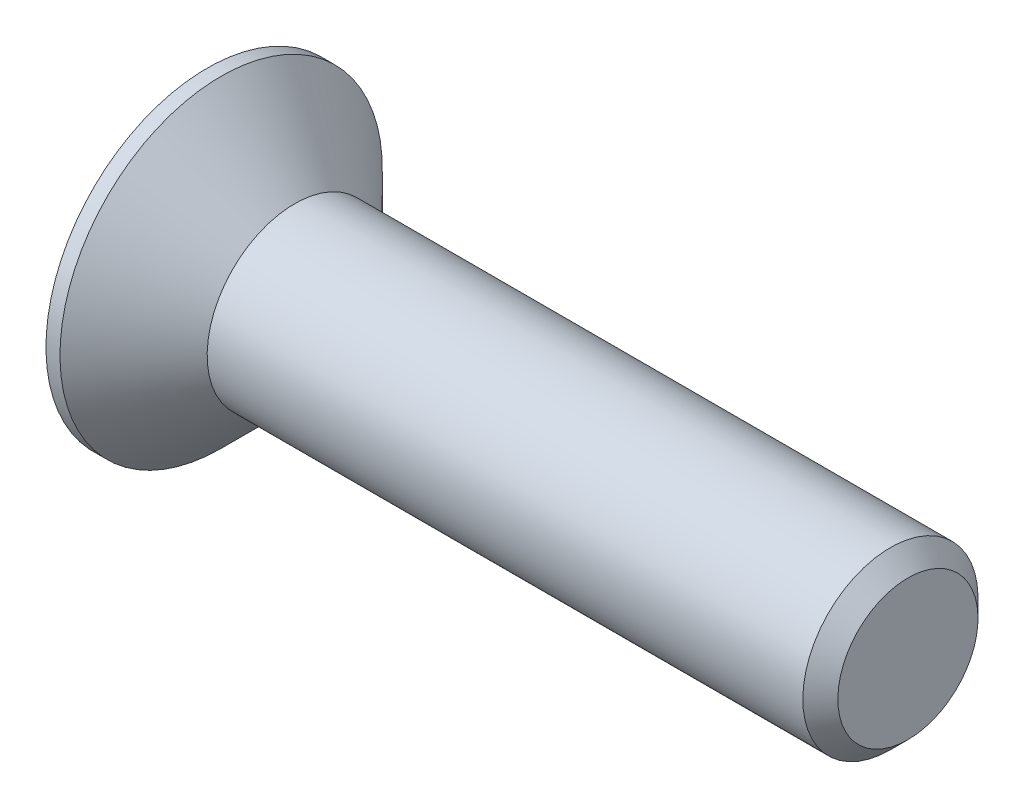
from build123d import *

# Parameters (mm, degrees)
CHAMFER1_SIZE      = 0.5
CUT_EXTRUDE1_DEPTH = 2.1


with BuildPart() as part:
    # Sketch1 → Revolve1 (revolve)
    with BuildSketch(Plane.XY, mode=Mode.PRIVATE) as revolve1_sk:
        Polygon((-2.5, 4.6), (-2.5, 0), (17.5, 0), (17.5, 2.5), (0, 2.5), (-2.1, 4.6), align=None)
    revolve(revolve1_sk.sketch.rotate(Axis((-2.5, 0, 0), (1, 0, 0)), 180), axis=Axis((-2.5, 0, 0), (1, 0, 0)))

    # Chamfer1
    chamfer1_edges = [part.edges().sort_by_distance(p)[0] for p in [
        (17.5, 2.5, 0),
    ]]
    chamfer(chamfer1_edges, length=CHAMFER1_SIZE)

    # Sketch2 → Cut-Extrude1 (cut)
    with BuildSketch(Plane.ZY.offset(2.5)):
        Polygon((-0.575, 2.3), (0.575, 2.3), (0.575, 0.575), (2.3, 0.575), (2.3, -0.575), (0.575, -0.575), (0.575, -2.3), (-0.575, -2.3), (-0.575, -0.575), (-2.3, -0.575), (-2.3, 0.575), (-0.575, 0.575), align=None)
    extrude(amount=-CUT_EXTRUDE1_DEPTH, mode=Mode.SUBTRACT)


solid = part.part
